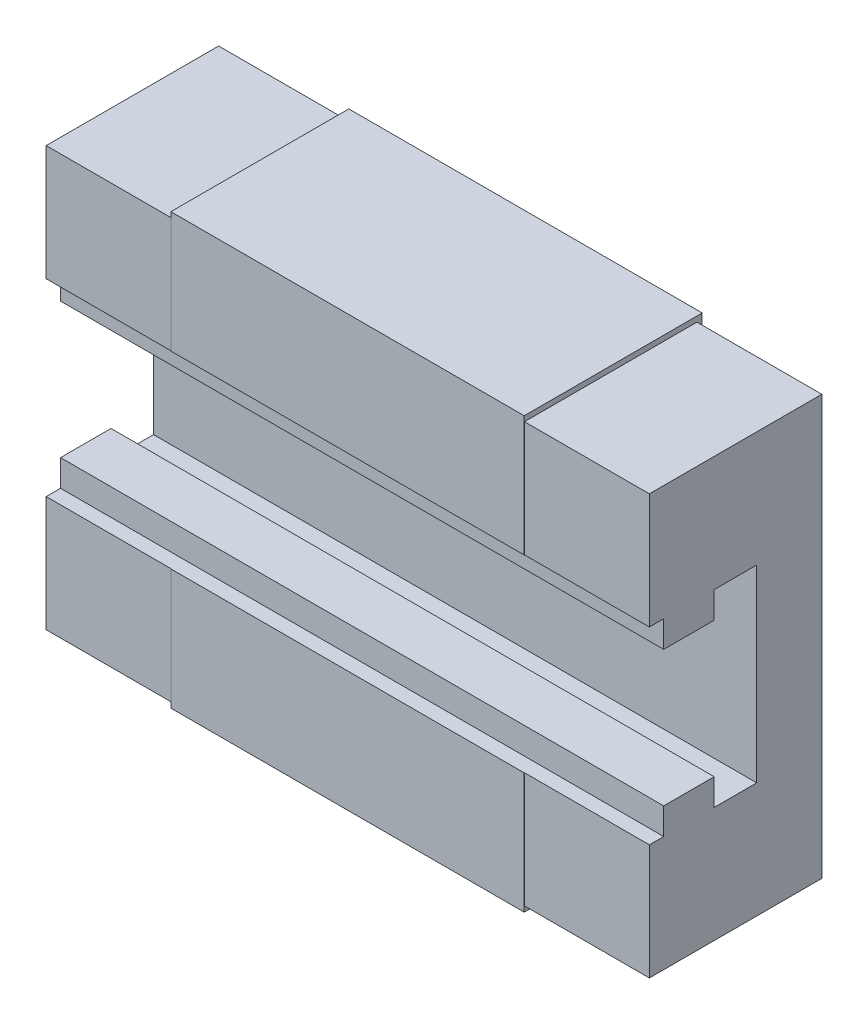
ISO-10303-21;
HEADER;
FILE_DESCRIPTION(('STEP AP214'),'2;1');
FILE_NAME('part.step','',(''),(''),'','','');
FILE_SCHEMA(('AUTOMOTIVE_DESIGN { 1 0 10303 214 1 1 1 1 }'));
ENDSEC;
DATA;
#1=APPLICATION_CONTEXT('core data for automotive mechanical design processes');
#2=APPLICATION_PROTOCOL_DEFINITION('international standard','automotive_design',2000,#1);
#3=PRODUCT_CONTEXT('',#1,'mechanical');
#4=PRODUCT('Part','Part','',(#3));
#5=PRODUCT_RELATED_PRODUCT_CATEGORY('part','',(#4));
#6=PRODUCT_DEFINITION_FORMATION('','',#4);
#7=PRODUCT_DEFINITION_CONTEXT('part definition',#1,'design');
#8=PRODUCT_DEFINITION('design','',#6,#7);
#9=PRODUCT_DEFINITION_SHAPE('','',#8);
#10=(LENGTH_UNIT() NAMED_UNIT(*) SI_UNIT(.MILLI.,.METRE.));
#11=(NAMED_UNIT(*) PLANE_ANGLE_UNIT() SI_UNIT($,.RADIAN.));
#12=(NAMED_UNIT(*) SI_UNIT($,.STERADIAN.) SOLID_ANGLE_UNIT());
#13=UNCERTAINTY_MEASURE_WITH_UNIT(LENGTH_MEASURE(1.E-05),#10,'distance_accuracy_value','');
#14=(GEOMETRIC_REPRESENTATION_CONTEXT(3) GLOBAL_UNCERTAINTY_ASSIGNED_CONTEXT((#13)) GLOBAL_UNIT_ASSIGNED_CONTEXT((#10,
#11,#12)) REPRESENTATION_CONTEXT('',''));
#15=CARTESIAN_POINT('',(0.,0.,0.));
#16=DIRECTION('',(0.,0.,1.));
#17=DIRECTION('',(1.,0.,0.));
#18=AXIS2_PLACEMENT_3D('',#15,#16,#17);
#19=CARTESIAN_POINT('',(0.,0.,6.7));
#20=DIRECTION('',(0.,0.,-1.));
#21=DIRECTION('',(-1.,0.,0.));
#22=AXIS2_PLACEMENT_3D('',#19,#20,#21);
#23=PLANE('',#22);
#24=DIRECTION('',(0.,1.,0.));
#25=VECTOR('',#24,1.);
#26=CARTESIAN_POINT('',(13.3,0.,6.7));
#27=LINE('',#26,#25);
#28=CARTESIAN_POINT('',(13.3,0.,6.7));
#29=VERTEX_POINT('',#28);
#30=CARTESIAN_POINT('',(13.3,4.54,6.7));
#31=VERTEX_POINT('',#30);
#32=EDGE_CURVE('E252',#29,#31,#27,.T.);
#33=ORIENTED_EDGE('',*,*,#32,.T.);
#34=DIRECTION('',(-1.,0.,0.));
#35=VECTOR('',#34,1.);
#36=CARTESIAN_POINT('',(0.,4.54,6.7));
#37=LINE('',#36,#35);
#38=CARTESIAN_POINT('',(0.,4.54,6.7));
#39=VERTEX_POINT('',#38);
#40=EDGE_CURVE('E246',#31,#39,#37,.T.);
#41=ORIENTED_EDGE('',*,*,#40,.T.);
#42=DIRECTION('',(0.,-1.,0.));
#43=VECTOR('',#42,1.);
#44=CARTESIAN_POINT('',(0.,0.,6.7));
#45=LINE('',#44,#43);
#46=CARTESIAN_POINT('',(0.,0.,6.7));
#47=VERTEX_POINT('',#46);
#48=EDGE_CURVE('E230',#39,#47,#45,.T.);
#49=ORIENTED_EDGE('',*,*,#48,.T.);
#50=DIRECTION('',(1.,0.,0.));
#51=VECTOR('',#50,1.);
#52=CARTESIAN_POINT('',(0.,0.,6.7));
#53=LINE('',#52,#51);
#54=EDGE_CURVE('E306',#47,#29,#53,.T.);
#55=ORIENTED_EDGE('',*,*,#54,.T.);
#56=EDGE_LOOP('',(#33,#41,#49,#55));
#57=FACE_BOUND('',#56,.T.);
#58=ADVANCED_FACE('F45',(#57),#23,.F.);
#59=DIRECTION('',(1.,0.,0.));
#60=VECTOR('',#59,1.);
#61=CARTESIAN_POINT('',(0.,11.64,6.7));
#62=LINE('',#61,#60);
#63=CARTESIAN_POINT('',(0.,11.64,6.7));
#64=VERTEX_POINT('',#63);
#65=CARTESIAN_POINT('',(13.3,11.64,6.7));
#66=VERTEX_POINT('',#65);
#67=EDGE_CURVE('E255',#64,#66,#62,.T.);
#68=ORIENTED_EDGE('',*,*,#67,.T.);
#69=CARTESIAN_POINT('',(13.3,16.18,6.7));
#70=VERTEX_POINT('',#69);
#71=EDGE_CURVE('E308',#66,#70,#27,.T.);
#72=ORIENTED_EDGE('',*,*,#71,.T.);
#73=DIRECTION('',(-1.,0.,0.));
#74=VECTOR('',#73,1.);
#75=CARTESIAN_POINT('',(0.,16.18,6.7));
#76=LINE('',#75,#74);
#77=CARTESIAN_POINT('',(0.,16.18,6.7));
#78=VERTEX_POINT('',#77);
#79=EDGE_CURVE('E310',#70,#78,#76,.T.);
#80=ORIENTED_EDGE('',*,*,#79,.T.);
#81=EDGE_CURVE('E239',#78,#64,#45,.T.);
#82=ORIENTED_EDGE('',*,*,#81,.T.);
#83=EDGE_LOOP('',(#68,#72,#80,#82));
#84=FACE_BOUND('',#83,.T.);
#85=ADVANCED_FACE('F343',(#84),#23,.F.);
#86=CARTESIAN_POINT('',(18.,0.20000000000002,0.));
#87=DIRECTION('',(0.,-1.,0.));
#88=DIRECTION('',(0.,0.,-1.));
#89=AXIS2_PLACEMENT_3D('',#86,#87,#88);
#90=PLANE('',#89);
#91=DIRECTION('',(0.,0.,1.));
#92=VECTOR('',#91,1.);
#93=CARTESIAN_POINT('',(18.,0.20000000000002,0.));
#94=LINE('',#93,#92);
#95=CARTESIAN_POINT('',(18.,0.2,0.2));
#96=VERTEX_POINT('',#95);
#97=CARTESIAN_POINT('',(18.,0.2,6.69));
#98=VERTEX_POINT('',#97);
#99=EDGE_CURVE('E283',#96,#98,#94,.T.);
#100=ORIENTED_EDGE('',*,*,#99,.T.);
#101=DIRECTION('',(1.,0.,0.));
#102=VECTOR('',#101,1.);
#103=CARTESIAN_POINT('',(13.3,0.2,6.69));
#104=LINE('',#103,#102);
#105=CARTESIAN_POINT('',(13.3,0.2,6.69));
#106=VERTEX_POINT('',#105);
#107=EDGE_CURVE('E523',#106,#98,#104,.T.);
#108=ORIENTED_EDGE('',*,*,#107,.F.);
#109=DIRECTION('',(0.,0.,1.));
#110=VECTOR('',#109,1.);
#111=CARTESIAN_POINT('',(13.3,0.20000000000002,0.));
#112=LINE('',#111,#110);
#113=CARTESIAN_POINT('',(13.3,0.2,0.2));
#114=VERTEX_POINT('',#113);
#115=EDGE_CURVE('E282',#114,#106,#112,.T.);
#116=ORIENTED_EDGE('',*,*,#115,.F.);
#117=DIRECTION('',(-1.,0.,0.));
#118=VECTOR('',#117,1.);
#119=CARTESIAN_POINT('',(18.,0.2,0.2));
#120=LINE('',#119,#118);
#121=EDGE_CURVE('E302',#96,#114,#120,.T.);
#122=ORIENTED_EDGE('',*,*,#121,.F.);
#123=EDGE_LOOP('',(#100,#108,#116,#122));
#124=FACE_BOUND('',#123,.T.);
#125=ADVANCED_FACE('F531',(#124),#90,.T.);
#126=CARTESIAN_POINT('',(18.,15.98,0.));
#127=DIRECTION('',(0.,-1.,0.));
#128=DIRECTION('',(0.,0.,-1.));
#129=AXIS2_PLACEMENT_3D('',#126,#127,#128);
#130=PLANE('',#129);
#131=DIRECTION('',(-1.,0.,0.));
#132=VECTOR('',#131,1.);
#133=CARTESIAN_POINT('',(18.,15.98,6.69));
#134=LINE('',#133,#132);
#135=CARTESIAN_POINT('',(18.,15.98,6.69));
#136=VERTEX_POINT('',#135);
#137=CARTESIAN_POINT('',(13.3,15.98,6.69));
#138=VERTEX_POINT('',#137);
#139=EDGE_CURVE('E364',#136,#138,#134,.T.);
#140=ORIENTED_EDGE('',*,*,#139,.F.);
#141=DIRECTION('',(0.,0.,1.));
#142=VECTOR('',#141,1.);
#143=CARTESIAN_POINT('',(18.,15.98,0.));
#144=LINE('',#143,#142);
#145=CARTESIAN_POINT('',(18.,15.98,0.2));
#146=VERTEX_POINT('',#145);
#147=EDGE_CURVE('E289',#146,#136,#144,.T.);
#148=ORIENTED_EDGE('',*,*,#147,.F.);
#149=DIRECTION('',(-1.,0.,0.));
#150=VECTOR('',#149,1.);
#151=CARTESIAN_POINT('',(18.,15.98,0.2));
#152=LINE('',#151,#150);
#153=CARTESIAN_POINT('',(13.3,15.98,0.2));
#154=VERTEX_POINT('',#153);
#155=EDGE_CURVE('E292',#146,#154,#152,.T.);
#156=ORIENTED_EDGE('',*,*,#155,.T.);
#157=DIRECTION('',(0.,0.,1.));
#158=VECTOR('',#157,1.);
#159=CARTESIAN_POINT('',(13.3,15.98,0.));
#160=LINE('',#159,#158);
#161=EDGE_CURVE('E287',#154,#138,#160,.T.);
#162=ORIENTED_EDGE('',*,*,#161,.T.);
#163=EDGE_LOOP('',(#140,#148,#156,#162));
#164=FACE_BOUND('',#163,.T.);
#165=ADVANCED_FACE('F541',(#164),#130,.F.);
#166=CARTESIAN_POINT('',(18.,0.,0.));
#167=DIRECTION('',(1.,0.,0.));
#168=DIRECTION('',(0.,0.,-1.));
#169=AXIS2_PLACEMENT_3D('',#166,#167,#168);
#170=PLANE('',#169);
#171=ORIENTED_EDGE('',*,*,#147,.T.);
#172=DIRECTION('',(0.,1.,0.));
#173=VECTOR('',#172,1.);
#174=CARTESIAN_POINT('',(18.,11.64,6.69));
#175=LINE('',#174,#173);
#176=CARTESIAN_POINT('',(18.,11.64,6.69));
#177=VERTEX_POINT('',#176);
#178=EDGE_CURVE('E355',#177,#136,#175,.T.);
#179=ORIENTED_EDGE('',*,*,#178,.F.);
#180=DIRECTION('',(0.,0.,1.));
#181=VECTOR('',#180,1.);
#182=CARTESIAN_POINT('',(18.,11.64,6.15));
#183=LINE('',#182,#181);
#184=CARTESIAN_POINT('',(18.,11.64,6.15));
#185=VERTEX_POINT('',#184);
#186=EDGE_CURVE('E451',#185,#177,#183,.T.);
#187=ORIENTED_EDGE('',*,*,#186,.F.);
#188=DIRECTION('',(0.,1.,0.));
#189=VECTOR('',#188,1.);
#190=CARTESIAN_POINT('',(18.,10.64,6.15));
#191=LINE('',#190,#189);
#192=CARTESIAN_POINT('',(18.,10.64,6.15));
#193=VERTEX_POINT('',#192);
#194=EDGE_CURVE('E448',#193,#185,#191,.T.);
#195=ORIENTED_EDGE('',*,*,#194,.F.);
#196=DIRECTION('',(0.,0.,1.));
#197=VECTOR('',#196,1.);
#198=CARTESIAN_POINT('',(18.,10.64,4.25));
#199=LINE('',#198,#197);
#200=CARTESIAN_POINT('',(18.,10.64,4.25));
#201=VERTEX_POINT('',#200);
#202=EDGE_CURVE('E445',#201,#193,#199,.T.);
#203=ORIENTED_EDGE('',*,*,#202,.F.);
#204=DIRECTION('',(0.,-1.,0.));
#205=VECTOR('',#204,1.);
#206=CARTESIAN_POINT('',(18.,11.64,4.25));
#207=LINE('',#206,#205);
#208=CARTESIAN_POINT('',(18.,11.64,4.25));
#209=VERTEX_POINT('',#208);
#210=EDGE_CURVE('E442',#209,#201,#207,.T.);
#211=ORIENTED_EDGE('',*,*,#210,.F.);
#212=DIRECTION('',(0.,0.,1.));
#213=VECTOR('',#212,1.);
#214=CARTESIAN_POINT('',(18.,11.64,2.65));
#215=LINE('',#214,#213);
#216=CARTESIAN_POINT('',(18.,11.64,2.65));
#217=VERTEX_POINT('',#216);
#218=EDGE_CURVE('E439',#217,#209,#215,.T.);
#219=ORIENTED_EDGE('',*,*,#218,.F.);
#220=DIRECTION('',(0.,1.,0.));
#221=VECTOR('',#220,1.);
#222=CARTESIAN_POINT('',(18.,4.54,2.65));
#223=LINE('',#222,#221);
#224=CARTESIAN_POINT('',(18.,4.54,2.65));
#225=VERTEX_POINT('',#224);
#226=EDGE_CURVE('E402',#225,#217,#223,.T.);
#227=ORIENTED_EDGE('',*,*,#226,.F.);
#228=DIRECTION('',(0.,0.,-1.));
#229=VECTOR('',#228,1.);
#230=CARTESIAN_POINT('',(18.,4.54,4.25));
#231=LINE('',#230,#229);
#232=CARTESIAN_POINT('',(18.,4.54,4.25));
#233=VERTEX_POINT('',#232);
#234=EDGE_CURVE('E409',#233,#225,#231,.T.);
#235=ORIENTED_EDGE('',*,*,#234,.F.);
#236=DIRECTION('',(0.,-1.,0.));
#237=VECTOR('',#236,1.);
#238=CARTESIAN_POINT('',(18.,5.54,4.25));
#239=LINE('',#238,#237);
#240=CARTESIAN_POINT('',(18.,5.54,4.25));
#241=VERTEX_POINT('',#240);
#242=EDGE_CURVE('E461',#241,#233,#239,.T.);
#243=ORIENTED_EDGE('',*,*,#242,.F.);
#244=DIRECTION('',(0.,0.,-1.));
#245=VECTOR('',#244,1.);
#246=CARTESIAN_POINT('',(18.,5.54,6.15));
#247=LINE('',#246,#245);
#248=CARTESIAN_POINT('',(18.,5.54,6.15));
#249=VERTEX_POINT('',#248);
#250=EDGE_CURVE('E458',#249,#241,#247,.T.);
#251=ORIENTED_EDGE('',*,*,#250,.F.);
#252=DIRECTION('',(0.,1.,0.));
#253=VECTOR('',#252,1.);
#254=CARTESIAN_POINT('',(18.,4.54,6.15));
#255=LINE('',#254,#253);
#256=CARTESIAN_POINT('',(18.,4.54,6.15));
#257=VERTEX_POINT('',#256);
#258=EDGE_CURVE('E455',#257,#249,#255,.T.);
#259=ORIENTED_EDGE('',*,*,#258,.F.);
#260=DIRECTION('',(0.,0.,-1.));
#261=VECTOR('',#260,1.);
#262=CARTESIAN_POINT('',(18.,4.54,7.75));
#263=LINE('',#262,#261);
#264=CARTESIAN_POINT('',(18.,4.54,6.69));
#265=VERTEX_POINT('',#264);
#266=EDGE_CURVE('E453',#265,#257,#263,.T.);
#267=ORIENTED_EDGE('',*,*,#266,.F.);
#268=DIRECTION('',(0.,1.,0.));
#269=VECTOR('',#268,1.);
#270=CARTESIAN_POINT('',(18.,0.2,6.69));
#271=LINE('',#270,#269);
#272=EDGE_CURVE('E68',#98,#265,#271,.T.);
#273=ORIENTED_EDGE('',*,*,#272,.F.);
#274=ORIENTED_EDGE('',*,*,#99,.F.);
#275=DIRECTION('',(0.,1.,0.));
#276=VECTOR('',#275,1.);
#277=CARTESIAN_POINT('',(18.,0.,0.2));
#278=LINE('',#277,#276);
#279=EDGE_CURVE('E286',#96,#146,#278,.T.);
#280=ORIENTED_EDGE('',*,*,#279,.T.);
#281=EDGE_LOOP('',(#171,#179,#187,#195,#203,#211,#219,#227,#235,#243,#251,#259,#267,#273,#274,#280));
#282=FACE_BOUND('',#281,.T.);
#283=ADVANCED_FACE('F495',(#282),#170,.T.);
#284=CARTESIAN_POINT('',(-4.7,15.98,0.));
#285=DIRECTION('',(0.,-1.,0.));
#286=DIRECTION('',(0.,0.,-1.));
#287=AXIS2_PLACEMENT_3D('',#284,#285,#286);
#288=PLANE('',#287);
#289=DIRECTION('',(-1.,0.,0.));
#290=VECTOR('',#289,1.);
#291=CARTESIAN_POINT('',(0.,15.98,6.69));
#292=LINE('',#291,#290);
#293=CARTESIAN_POINT('',(0.,15.98,6.69));
#294=VERTEX_POINT('',#293);
#295=CARTESIAN_POINT('',(-4.7,15.98,6.69));
#296=VERTEX_POINT('',#295);
#297=EDGE_CURVE('E376',#294,#296,#292,.T.);
#298=ORIENTED_EDGE('',*,*,#297,.F.);
#299=DIRECTION('',(0.,0.,-1.));
#300=VECTOR('',#299,1.);
#301=CARTESIAN_POINT('',(0.,15.98,0.));
#302=LINE('',#301,#300);
#303=CARTESIAN_POINT('',(0.,15.98,0.2));
#304=VERTEX_POINT('',#303);
#305=EDGE_CURVE('E258',#294,#304,#302,.T.);
#306=ORIENTED_EDGE('',*,*,#305,.T.);
#307=DIRECTION('',(1.,0.,0.));
#308=VECTOR('',#307,1.);
#309=CARTESIAN_POINT('',(-4.7,15.98,0.2));
#310=LINE('',#309,#308);
#311=CARTESIAN_POINT('',(-4.7,15.98,0.2));
#312=VERTEX_POINT('',#311);
#313=EDGE_CURVE('E279',#312,#304,#310,.T.);
#314=ORIENTED_EDGE('',*,*,#313,.F.);
#315=DIRECTION('',(0.,0.,-1.));
#316=VECTOR('',#315,1.);
#317=CARTESIAN_POINT('',(-4.7,15.98,0.));
#318=LINE('',#317,#316);
#319=EDGE_CURVE('E268',#296,#312,#318,.T.);
#320=ORIENTED_EDGE('',*,*,#319,.F.);
#321=EDGE_LOOP('',(#298,#306,#314,#320));
#322=FACE_BOUND('',#321,.T.);
#323=ADVANCED_FACE('F603',(#322),#288,.F.);
#324=CARTESIAN_POINT('',(-4.7,0.,0.));
#325=DIRECTION('',(-1.,0.,0.));
#326=DIRECTION('',(0.,0.,1.));
#327=AXIS2_PLACEMENT_3D('',#324,#325,#326);
#328=PLANE('',#327);
#329=DIRECTION('',(0.,-1.,0.));
#330=VECTOR('',#329,1.);
#331=CARTESIAN_POINT('',(-4.7,4.54,6.69));
#332=LINE('',#331,#330);
#333=CARTESIAN_POINT('',(-4.7,4.54,6.69));
#334=VERTEX_POINT('',#333);
#335=CARTESIAN_POINT('',(-4.7,0.199999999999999,6.69));
#336=VERTEX_POINT('',#335);
#337=EDGE_CURVE('E248',#334,#336,#332,.T.);
#338=ORIENTED_EDGE('',*,*,#337,.F.);
#339=DIRECTION('',(0.,0.,1.));
#340=VECTOR('',#339,1.);
#341=CARTESIAN_POINT('',(-4.7,4.54,0.));
#342=LINE('',#341,#340);
#343=CARTESIAN_POINT('',(-4.7,4.54,6.15));
#344=VERTEX_POINT('',#343);
#345=EDGE_CURVE('E11',#344,#334,#342,.T.);
#346=ORIENTED_EDGE('',*,*,#345,.F.);
#347=DIRECTION('',(0.,1.,0.));
#348=VECTOR('',#347,1.);
#349=CARTESIAN_POINT('',(-4.7,4.54,6.15));
#350=LINE('',#349,#348);
#351=CARTESIAN_POINT('',(-4.7,5.54,6.15));
#352=VERTEX_POINT('',#351);
#353=EDGE_CURVE('E424',#344,#352,#350,.T.);
#354=ORIENTED_EDGE('',*,*,#353,.T.);
#355=DIRECTION('',(0.,0.,-1.));
#356=VECTOR('',#355,1.);
#357=CARTESIAN_POINT('',(-4.7,5.54,6.15));
#358=LINE('',#357,#356);
#359=CARTESIAN_POINT('',(-4.7,5.54,4.25));
#360=VERTEX_POINT('',#359);
#361=EDGE_CURVE('E427',#352,#360,#358,.T.);
#362=ORIENTED_EDGE('',*,*,#361,.T.);
#363=DIRECTION('',(0.,-1.,0.));
#364=VECTOR('',#363,1.);
#365=CARTESIAN_POINT('',(-4.7,5.54,4.25));
#366=LINE('',#365,#364);
#367=CARTESIAN_POINT('',(-4.7,4.54,4.25));
#368=VERTEX_POINT('',#367);
#369=EDGE_CURVE('E430',#360,#368,#366,.T.);
#370=ORIENTED_EDGE('',*,*,#369,.T.);
#371=DIRECTION('',(0.,0.,-1.));
#372=VECTOR('',#371,1.);
#373=CARTESIAN_POINT('',(-4.7,4.54,4.25));
#374=LINE('',#373,#372);
#375=CARTESIAN_POINT('',(-4.7,4.54,2.65));
#376=VERTEX_POINT('',#375);
#377=EDGE_CURVE('E433',#368,#376,#374,.T.);
#378=ORIENTED_EDGE('',*,*,#377,.T.);
#379=DIRECTION('',(0.,1.,0.));
#380=VECTOR('',#379,1.);
#381=CARTESIAN_POINT('',(-4.7,4.54,2.65));
#382=LINE('',#381,#380);
#383=CARTESIAN_POINT('',(-4.7,11.64,2.65));
#384=VERTEX_POINT('',#383);
#385=EDGE_CURVE('E405',#376,#384,#382,.T.);
#386=ORIENTED_EDGE('',*,*,#385,.T.);
#387=DIRECTION('',(0.,0.,1.));
#388=VECTOR('',#387,1.);
#389=CARTESIAN_POINT('',(-4.7,11.64,2.65));
#390=LINE('',#389,#388);
#391=CARTESIAN_POINT('',(-4.7,11.64,4.25));
#392=VERTEX_POINT('',#391);
#393=EDGE_CURVE('E408',#384,#392,#390,.T.);
#394=ORIENTED_EDGE('',*,*,#393,.T.);
#395=DIRECTION('',(0.,-1.,0.));
#396=VECTOR('',#395,1.);
#397=CARTESIAN_POINT('',(-4.7,11.64,4.25));
#398=LINE('',#397,#396);
#399=CARTESIAN_POINT('',(-4.7,10.64,4.25));
#400=VERTEX_POINT('',#399);
#401=EDGE_CURVE('E412',#392,#400,#398,.T.);
#402=ORIENTED_EDGE('',*,*,#401,.T.);
#403=DIRECTION('',(0.,0.,1.));
#404=VECTOR('',#403,1.);
#405=CARTESIAN_POINT('',(-4.7,10.64,4.25));
#406=LINE('',#405,#404);
#407=CARTESIAN_POINT('',(-4.7,10.64,6.15));
#408=VERTEX_POINT('',#407);
#409=EDGE_CURVE('E415',#400,#408,#406,.T.);
#410=ORIENTED_EDGE('',*,*,#409,.T.);
#411=DIRECTION('',(0.,1.,0.));
#412=VECTOR('',#411,1.);
#413=CARTESIAN_POINT('',(-4.7,10.64,6.15));
#414=LINE('',#413,#412);
#415=CARTESIAN_POINT('',(-4.7,11.64,6.15));
#416=VERTEX_POINT('',#415);
#417=EDGE_CURVE('E418',#408,#416,#414,.T.);
#418=ORIENTED_EDGE('',*,*,#417,.T.);
#419=DIRECTION('',(0.,0.,1.));
#420=VECTOR('',#419,1.);
#421=CARTESIAN_POINT('',(-4.7,11.64,6.15));
#422=LINE('',#421,#420);
#423=CARTESIAN_POINT('',(-4.7,11.64,6.69));
#424=VERTEX_POINT('',#423);
#425=EDGE_CURVE('E421',#416,#424,#422,.T.);
#426=ORIENTED_EDGE('',*,*,#425,.T.);
#427=DIRECTION('',(0.,-1.,0.));
#428=VECTOR('',#427,1.);
#429=CARTESIAN_POINT('',(-4.7,15.98,6.69));
#430=LINE('',#429,#428);
#431=EDGE_CURVE('E374',#296,#424,#430,.T.);
#432=ORIENTED_EDGE('',*,*,#431,.F.);
#433=ORIENTED_EDGE('',*,*,#319,.T.);
#434=DIRECTION('',(0.,-1.,0.));
#435=VECTOR('',#434,1.);
#436=CARTESIAN_POINT('',(-4.7,0.,0.2));
#437=LINE('',#436,#435);
#438=CARTESIAN_POINT('',(-4.7,0.2,0.2));
#439=VERTEX_POINT('',#438);
#440=EDGE_CURVE('E271',#312,#439,#437,.T.);
#441=ORIENTED_EDGE('',*,*,#440,.T.);
#442=DIRECTION('',(0.,0.,1.));
#443=VECTOR('',#442,1.);
#444=CARTESIAN_POINT('',(-4.7,0.2,0.));
#445=LINE('',#444,#443);
#446=EDGE_CURVE('E265',#439,#336,#445,.T.);
#447=ORIENTED_EDGE('',*,*,#446,.T.);
#448=EDGE_LOOP('',(#338,#346,#354,#362,#370,#378,#386,#394,#402,#410,#418,#426,#432,#433,#441,#447));
#449=FACE_BOUND('',#448,.T.);
#450=ADVANCED_FACE('F503',(#449),#328,.T.);
#451=CARTESIAN_POINT('',(-4.7,4.54,7.75));
#452=DIRECTION('',(0.,-1.,0.));
#453=DIRECTION('',(0.,0.,-1.));
#454=AXIS2_PLACEMENT_3D('',#451,#452,#453);
#455=PLANE('',#454);
#456=ORIENTED_EDGE('',*,*,#40,.F.);
#457=DIRECTION('',(0.,0.,1.));
#458=VECTOR('',#457,1.);
#459=CARTESIAN_POINT('',(13.3,4.54,6.69));
#460=LINE('',#459,#458);
#461=CARTESIAN_POINT('',(13.3,4.54,6.69));
#462=VERTEX_POINT('',#461);
#463=EDGE_CURVE('E367',#462,#31,#460,.T.);
#464=ORIENTED_EDGE('',*,*,#463,.F.);
#465=DIRECTION('',(-1.,0.,0.));
#466=VECTOR('',#465,1.);
#467=CARTESIAN_POINT('',(18.,4.54,6.69));
#468=LINE('',#467,#466);
#469=EDGE_CURVE('E521',#265,#462,#468,.T.);
#470=ORIENTED_EDGE('',*,*,#469,.F.);
#471=ORIENTED_EDGE('',*,*,#266,.T.);
#472=DIRECTION('',(1.,0.,0.));
#473=VECTOR('',#472,1.);
#474=CARTESIAN_POINT('',(-4.7,4.54,6.15));
#475=LINE('',#474,#473);
#476=EDGE_CURVE('E473',#344,#257,#475,.T.);
#477=ORIENTED_EDGE('',*,*,#476,.F.);
#478=ORIENTED_EDGE('',*,*,#345,.T.);
#479=DIRECTION('',(-1.,0.,0.));
#480=VECTOR('',#479,1.);
#481=CARTESIAN_POINT('',(0.,4.54,6.69));
#482=LINE('',#481,#480);
#483=CARTESIAN_POINT('',(0.,4.54,6.69));
#484=VERTEX_POINT('',#483);
#485=EDGE_CURVE('E247',#484,#334,#482,.T.);
#486=ORIENTED_EDGE('',*,*,#485,.F.);
#487=DIRECTION('',(0.,0.,1.));
#488=VECTOR('',#487,1.);
#489=CARTESIAN_POINT('',(0.,4.54,6.69));
#490=LINE('',#489,#488);
#491=EDGE_CURVE('E232',#484,#39,#490,.T.);
#492=ORIENTED_EDGE('',*,*,#491,.T.);
#493=EDGE_LOOP('',(#456,#464,#470,#471,#477,#478,#486,#492));
#494=FACE_BOUND('',#493,.T.);
#495=ADVANCED_FACE('F244',(#494),#455,.F.);
#496=CARTESIAN_POINT('',(-4.7,11.64,6.15));
#497=DIRECTION('',(0.,1.,0.));
#498=DIRECTION('',(0.,0.,1.));
#499=AXIS2_PLACEMENT_3D('',#496,#497,#498);
#500=PLANE('',#499);
#501=DIRECTION('',(1.,0.,0.));
#502=VECTOR('',#501,1.);
#503=CARTESIAN_POINT('',(13.3,11.64,6.69));
#504=LINE('',#503,#502);
#505=CARTESIAN_POINT('',(13.3,11.64,6.69));
#506=VERTEX_POINT('',#505);
#507=EDGE_CURVE('E354',#506,#177,#504,.T.);
#508=ORIENTED_EDGE('',*,*,#507,.F.);
#509=DIRECTION('',(0.,0.,1.));
#510=VECTOR('',#509,1.);
#511=CARTESIAN_POINT('',(13.3,11.64,6.69));
#512=LINE('',#511,#510);
#513=EDGE_CURVE('E348',#506,#66,#512,.T.);
#514=ORIENTED_EDGE('',*,*,#513,.T.);
#515=ORIENTED_EDGE('',*,*,#67,.F.);
#516=DIRECTION('',(0.,0.,1.));
#517=VECTOR('',#516,1.);
#518=CARTESIAN_POINT('',(0.,11.64,6.69));
#519=LINE('',#518,#517);
#520=CARTESIAN_POINT('',(0.,11.64,6.69));
#521=VERTEX_POINT('',#520);
#522=EDGE_CURVE('E378',#521,#64,#519,.T.);
#523=ORIENTED_EDGE('',*,*,#522,.F.);
#524=DIRECTION('',(1.,0.,0.));
#525=VECTOR('',#524,1.);
#526=CARTESIAN_POINT('',(-4.7,11.64,6.69));
#527=LINE('',#526,#525);
#528=EDGE_CURVE('E370',#424,#521,#527,.T.);
#529=ORIENTED_EDGE('',*,*,#528,.F.);
#530=ORIENTED_EDGE('',*,*,#425,.F.);
#531=DIRECTION('',(1.,0.,0.));
#532=VECTOR('',#531,1.);
#533=CARTESIAN_POINT('',(-4.7,11.64,6.15));
#534=LINE('',#533,#532);
#535=EDGE_CURVE('E476',#416,#185,#534,.T.);
#536=ORIENTED_EDGE('',*,*,#535,.T.);
#537=ORIENTED_EDGE('',*,*,#186,.T.);
#538=EDGE_LOOP('',(#508,#514,#515,#523,#529,#530,#536,#537));
#539=FACE_BOUND('',#538,.T.);
#540=ADVANCED_FACE('F351',(#539),#500,.F.);
#541=CARTESIAN_POINT('',(0.,0.,6.7));
#542=DIRECTION('',(1.,0.,0.));
#543=DIRECTION('',(0.,0.,-1.));
#544=AXIS2_PLACEMENT_3D('',#541,#542,#543);
#545=PLANE('',#544);
#546=DIRECTION('',(0.,0.,1.));
#547=VECTOR('',#546,1.);
#548=CARTESIAN_POINT('',(0.,0.2,0.));
#549=LINE('',#548,#547);
#550=CARTESIAN_POINT('',(0.,0.2,0.2));
#551=VERTEX_POINT('',#550);
#552=CARTESIAN_POINT('',(0.,0.2,6.69));
#553=VERTEX_POINT('',#552);
#554=EDGE_CURVE('E254',#551,#553,#549,.T.);
#555=ORIENTED_EDGE('',*,*,#554,.F.);
#556=DIRECTION('',(0.,-1.,0.));
#557=VECTOR('',#556,1.);
#558=CARTESIAN_POINT('',(0.,0.,0.2));
#559=LINE('',#558,#557);
#560=EDGE_CURVE('E269',#304,#551,#559,.T.);
#561=ORIENTED_EDGE('',*,*,#560,.F.);
#562=ORIENTED_EDGE('',*,*,#305,.F.);
#563=DIRECTION('',(0.,-1.,0.));
#564=VECTOR('',#563,1.);
#565=CARTESIAN_POINT('',(0.,15.98,6.69));
#566=LINE('',#565,#564);
#567=EDGE_CURVE('E368',#294,#521,#566,.T.);
#568=ORIENTED_EDGE('',*,*,#567,.T.);
#569=ORIENTED_EDGE('',*,*,#522,.T.);
#570=ORIENTED_EDGE('',*,*,#81,.F.);
#571=DIRECTION('',(0.,0.,-1.));
#572=VECTOR('',#571,1.);
#573=CARTESIAN_POINT('',(0.,16.18,6.7));
#574=LINE('',#573,#572);
#575=CARTESIAN_POINT('',(0.,16.18,0.));
#576=VERTEX_POINT('',#575);
#577=EDGE_CURVE('E312',#78,#576,#574,.T.);
#578=ORIENTED_EDGE('',*,*,#577,.T.);
#579=DIRECTION('',(0.,-1.,0.));
#580=VECTOR('',#579,1.);
#581=CARTESIAN_POINT('',(0.,0.,0.));
#582=LINE('',#581,#580);
#583=CARTESIAN_POINT('',(0.,0.,0.));
#584=VERTEX_POINT('',#583);
#585=EDGE_CURVE('E304',#576,#584,#582,.T.);
#586=ORIENTED_EDGE('',*,*,#585,.T.);
#587=DIRECTION('',(0.,0.,-1.));
#588=VECTOR('',#587,1.);
#589=CARTESIAN_POINT('',(0.,0.,6.7));
#590=LINE('',#589,#588);
#591=EDGE_CURVE('E53',#47,#584,#590,.T.);
#592=ORIENTED_EDGE('',*,*,#591,.F.);
#593=ORIENTED_EDGE('',*,*,#48,.F.);
#594=ORIENTED_EDGE('',*,*,#491,.F.);
#595=DIRECTION('',(0.,-1.,0.));
#596=VECTOR('',#595,1.);
#597=CARTESIAN_POINT('',(0.,4.54,6.69));
#598=LINE('',#597,#596);
#599=EDGE_CURVE('E60',#484,#553,#598,.T.);
#600=ORIENTED_EDGE('',*,*,#599,.T.);
#601=EDGE_LOOP('',(#555,#561,#562,#568,#569,#570,#578,#586,#592,#593,#594,#600));
#602=FACE_BOUND('',#601,.T.);
#603=ADVANCED_FACE('F47',(#602),#545,.F.);
#604=CARTESIAN_POINT('',(0.,0.,6.7));
#605=DIRECTION('',(0.,1.,0.));
#606=DIRECTION('',(0.,0.,1.));
#607=AXIS2_PLACEMENT_3D('',#604,#605,#606);
#608=PLANE('',#607);
#609=DIRECTION('',(1.,0.,0.));
#610=VECTOR('',#609,1.);
#611=CARTESIAN_POINT('',(0.,0.,0.));
#612=LINE('',#611,#610);
#613=CARTESIAN_POINT('',(13.3,0.,0.));
#614=VERTEX_POINT('',#613);
#615=EDGE_CURVE('E314',#584,#614,#612,.T.);
#616=ORIENTED_EDGE('',*,*,#615,.T.);
#617=DIRECTION('',(0.,0.,-1.));
#618=VECTOR('',#617,1.);
#619=CARTESIAN_POINT('',(13.3,0.,6.7));
#620=LINE('',#619,#618);
#621=EDGE_CURVE('E324',#29,#614,#620,.T.);
#622=ORIENTED_EDGE('',*,*,#621,.F.);
#623=ORIENTED_EDGE('',*,*,#54,.F.);
#624=ORIENTED_EDGE('',*,*,#591,.T.);
#625=EDGE_LOOP('',(#616,#622,#623,#624));
#626=FACE_BOUND('',#625,.T.);
#627=ADVANCED_FACE('F327',(#626),#608,.F.);
#628=CARTESIAN_POINT('',(13.3,0.,6.7));
#629=DIRECTION('',(-1.,0.,0.));
#630=DIRECTION('',(0.,0.,1.));
#631=AXIS2_PLACEMENT_3D('',#628,#629,#630);
#632=PLANE('',#631);
#633=DIRECTION('',(0.,1.,0.));
#634=VECTOR('',#633,1.);
#635=CARTESIAN_POINT('',(13.3,0.,0.2));
#636=LINE('',#635,#634);
#637=EDGE_CURVE('E295',#114,#154,#636,.T.);
#638=ORIENTED_EDGE('',*,*,#637,.F.);
#639=ORIENTED_EDGE('',*,*,#115,.T.);
#640=DIRECTION('',(0.,-1.,0.));
#641=VECTOR('',#640,1.);
#642=CARTESIAN_POINT('',(13.3,4.54,6.69));
#643=LINE('',#642,#641);
#644=EDGE_CURVE('E249',#462,#106,#643,.T.);
#645=ORIENTED_EDGE('',*,*,#644,.F.);
#646=ORIENTED_EDGE('',*,*,#463,.T.);
#647=ORIENTED_EDGE('',*,*,#32,.F.);
#648=ORIENTED_EDGE('',*,*,#621,.T.);
#649=DIRECTION('',(0.,1.,0.));
#650=VECTOR('',#649,1.);
#651=CARTESIAN_POINT('',(13.3,0.,0.));
#652=LINE('',#651,#650);
#653=CARTESIAN_POINT('',(13.3,16.18,0.));
#654=VERTEX_POINT('',#653);
#655=EDGE_CURVE('E316',#614,#654,#652,.T.);
#656=ORIENTED_EDGE('',*,*,#655,.T.);
#657=DIRECTION('',(0.,0.,-1.));
#658=VECTOR('',#657,1.);
#659=CARTESIAN_POINT('',(13.3,16.18,6.7));
#660=LINE('',#659,#658);
#661=EDGE_CURVE('E321',#70,#654,#660,.T.);
#662=ORIENTED_EDGE('',*,*,#661,.F.);
#663=ORIENTED_EDGE('',*,*,#71,.F.);
#664=ORIENTED_EDGE('',*,*,#513,.F.);
#665=DIRECTION('',(0.,-1.,0.));
#666=VECTOR('',#665,1.);
#667=CARTESIAN_POINT('',(13.3,15.98,6.69));
#668=LINE('',#667,#666);
#669=EDGE_CURVE('E362',#138,#506,#668,.T.);
#670=ORIENTED_EDGE('',*,*,#669,.F.);
#671=ORIENTED_EDGE('',*,*,#161,.F.);
#672=EDGE_LOOP('',(#638,#639,#645,#646,#647,#648,#656,#662,#663,#664,#670,#671));
#673=FACE_BOUND('',#672,.T.);
#674=ADVANCED_FACE('F338',(#673),#632,.F.);
#675=CARTESIAN_POINT('',(0.,16.18,6.7));
#676=DIRECTION('',(0.,-1.,0.));
#677=DIRECTION('',(0.,0.,-1.));
#678=AXIS2_PLACEMENT_3D('',#675,#676,#677);
#679=PLANE('',#678);
#680=DIRECTION('',(-1.,0.,0.));
#681=VECTOR('',#680,1.);
#682=CARTESIAN_POINT('',(0.,16.18,0.));
#683=LINE('',#682,#681);
#684=EDGE_CURVE('E240',#654,#576,#683,.T.);
#685=ORIENTED_EDGE('',*,*,#684,.T.);
#686=ORIENTED_EDGE('',*,*,#577,.F.);
#687=ORIENTED_EDGE('',*,*,#79,.F.);
#688=ORIENTED_EDGE('',*,*,#661,.T.);
#689=EDGE_LOOP('',(#685,#686,#687,#688));
#690=FACE_BOUND('',#689,.T.);
#691=ADVANCED_FACE('F341',(#690),#679,.F.);
#692=CARTESIAN_POINT('',(0.,0.,0.));
#693=DIRECTION('',(0.,0.,-1.));
#694=DIRECTION('',(-1.,0.,0.));
#695=AXIS2_PLACEMENT_3D('',#692,#693,#694);
#696=PLANE('',#695);
#697=CARTESIAN_POINT('',(2.65,14.09,0.));
#698=DIRECTION('',(0.,0.,-1.));
#699=DIRECTION('',(-1.,0.,0.));
#700=AXIS2_PLACEMENT_3D('',#697,#698,#699);
#701=CIRCLE('',#700,1.05);
#702=CARTESIAN_POINT('',(1.6,14.09,0.));
#703=VERTEX_POINT('',#702);
#704=EDGE_CURVE('E391',#703,#703,#701,.T.);
#705=ORIENTED_EDGE('',*,*,#704,.F.);
#706=EDGE_LOOP('',(#705));
#707=FACE_BOUND('',#706,.T.);
#708=CARTESIAN_POINT('',(10.65,2.09,0.));
#709=DIRECTION('',(0.,0.,-1.));
#710=DIRECTION('',(-1.,0.,0.));
#711=AXIS2_PLACEMENT_3D('',#708,#709,#710);
#712=CIRCLE('',#711,1.05);
#713=CARTESIAN_POINT('',(9.6,2.09,0.));
#714=VERTEX_POINT('',#713);
#715=EDGE_CURVE('E384',#714,#714,#712,.T.);
#716=ORIENTED_EDGE('',*,*,#715,.F.);
#717=EDGE_LOOP('',(#716));
#718=FACE_BOUND('',#717,.T.);
#719=CARTESIAN_POINT('',(2.65,2.09,0.));
#720=DIRECTION('',(0.,0.,-1.));
#721=DIRECTION('',(-1.,0.,0.));
#722=AXIS2_PLACEMENT_3D('',#719,#720,#721);
#723=CIRCLE('',#722,1.05);
#724=CARTESIAN_POINT('',(1.6,2.09,0.));
#725=VERTEX_POINT('',#724);
#726=EDGE_CURVE('E380',#725,#725,#723,.T.);
#727=ORIENTED_EDGE('',*,*,#726,.F.);
#728=EDGE_LOOP('',(#727));
#729=FACE_BOUND('',#728,.T.);
#730=CARTESIAN_POINT('',(10.65,14.09,0.));
#731=DIRECTION('',(0.,0.,-1.));
#732=DIRECTION('',(-1.,0.,0.));
#733=AXIS2_PLACEMENT_3D('',#730,#731,#732);
#734=CIRCLE('',#733,1.05);
#735=CARTESIAN_POINT('',(9.6,14.09,0.));
#736=VERTEX_POINT('',#735);
#737=EDGE_CURVE('E390',#736,#736,#734,.T.);
#738=ORIENTED_EDGE('',*,*,#737,.F.);
#739=EDGE_LOOP('',(#738));
#740=FACE_BOUND('',#739,.T.);
#741=ORIENTED_EDGE('',*,*,#585,.F.);
#742=ORIENTED_EDGE('',*,*,#684,.F.);
#743=ORIENTED_EDGE('',*,*,#655,.F.);
#744=ORIENTED_EDGE('',*,*,#615,.F.);
#745=EDGE_LOOP('',(#741,#742,#743,#744));
#746=FACE_BOUND('',#745,.T.);
#747=ADVANCED_FACE('F334',(#707,#718,#729,#740,#746),#696,.T.);
#748=CARTESIAN_POINT('',(18.,0.,0.2));
#749=DIRECTION('',(0.,0.,1.));
#750=DIRECTION('',(1.,0.,0.));
#751=AXIS2_PLACEMENT_3D('',#748,#749,#750);
#752=PLANE('',#751);
#753=ORIENTED_EDGE('',*,*,#637,.T.);
#754=ORIENTED_EDGE('',*,*,#155,.F.);
#755=ORIENTED_EDGE('',*,*,#279,.F.);
#756=ORIENTED_EDGE('',*,*,#121,.T.);
#757=EDGE_LOOP('',(#753,#754,#755,#756));
#758=FACE_BOUND('',#757,.T.);
#759=ADVANCED_FACE('F535',(#758),#752,.F.);
#760=CARTESIAN_POINT('',(-4.7,0.2,0.));
#761=DIRECTION('',(0.,1.,0.));
#762=DIRECTION('',(0.,0.,1.));
#763=AXIS2_PLACEMENT_3D('',#760,#761,#762);
#764=PLANE('',#763);
#765=ORIENTED_EDGE('',*,*,#554,.T.);
#766=DIRECTION('',(1.,0.,0.));
#767=VECTOR('',#766,1.);
#768=CARTESIAN_POINT('',(-4.7,0.199999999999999,6.69));
#769=LINE('',#768,#767);
#770=EDGE_CURVE('E371',#336,#553,#769,.T.);
#771=ORIENTED_EDGE('',*,*,#770,.F.);
#772=ORIENTED_EDGE('',*,*,#446,.F.);
#773=DIRECTION('',(1.,0.,0.));
#774=VECTOR('',#773,1.);
#775=CARTESIAN_POINT('',(-4.7,0.2,0.2));
#776=LINE('',#775,#774);
#777=EDGE_CURVE('E272',#439,#551,#776,.T.);
#778=ORIENTED_EDGE('',*,*,#777,.T.);
#779=EDGE_LOOP('',(#765,#771,#772,#778));
#780=FACE_BOUND('',#779,.T.);
#781=ADVANCED_FACE('F606',(#780),#764,.F.);
#782=CARTESIAN_POINT('',(-4.7,0.,0.2));
#783=DIRECTION('',(0.,0.,1.));
#784=DIRECTION('',(1.,0.,0.));
#785=AXIS2_PLACEMENT_3D('',#782,#783,#784);
#786=PLANE('',#785);
#787=ORIENTED_EDGE('',*,*,#560,.T.);
#788=ORIENTED_EDGE('',*,*,#777,.F.);
#789=ORIENTED_EDGE('',*,*,#440,.F.);
#790=ORIENTED_EDGE('',*,*,#313,.T.);
#791=EDGE_LOOP('',(#787,#788,#789,#790));
#792=FACE_BOUND('',#791,.T.);
#793=ADVANCED_FACE('F600',(#792),#786,.F.);
#794=CARTESIAN_POINT('',(-4.7,4.54,2.65));
#795=DIRECTION('',(0.,0.,-1.));
#796=DIRECTION('',(-1.,0.,0.));
#797=AXIS2_PLACEMENT_3D('',#794,#795,#796);
#798=PLANE('',#797);
#799=ORIENTED_EDGE('',*,*,#226,.T.);
#800=DIRECTION('',(1.,0.,0.));
#801=VECTOR('',#800,1.);
#802=CARTESIAN_POINT('',(-4.7,11.64,2.65));
#803=LINE('',#802,#801);
#804=EDGE_CURVE('E436',#384,#217,#803,.T.);
#805=ORIENTED_EDGE('',*,*,#804,.F.);
#806=ORIENTED_EDGE('',*,*,#385,.F.);
#807=DIRECTION('',(1.,0.,0.));
#808=VECTOR('',#807,1.);
#809=CARTESIAN_POINT('',(-4.7,4.54,2.65));
#810=LINE('',#809,#808);
#811=EDGE_CURVE('E261',#376,#225,#810,.T.);
#812=ORIENTED_EDGE('',*,*,#811,.T.);
#813=EDGE_LOOP('',(#799,#805,#806,#812));
#814=FACE_BOUND('',#813,.T.);
#815=ADVANCED_FACE('F492',(#814),#798,.F.);
#816=CARTESIAN_POINT('',(-4.7,4.54,4.25));
#817=DIRECTION('',(0.,-1.,0.));
#818=DIRECTION('',(0.,0.,-1.));
#819=AXIS2_PLACEMENT_3D('',#816,#817,#818);
#820=PLANE('',#819);
#821=ORIENTED_EDGE('',*,*,#234,.T.);
#822=ORIENTED_EDGE('',*,*,#811,.F.);
#823=ORIENTED_EDGE('',*,*,#377,.F.);
#824=DIRECTION('',(1.,0.,0.));
#825=VECTOR('',#824,1.);
#826=CARTESIAN_POINT('',(-4.7,4.54,4.25));
#827=LINE('',#826,#825);
#828=EDGE_CURVE('E467',#368,#233,#827,.T.);
#829=ORIENTED_EDGE('',*,*,#828,.T.);
#830=EDGE_LOOP('',(#821,#822,#823,#829));
#831=FACE_BOUND('',#830,.T.);
#832=ADVANCED_FACE('F507',(#831),#820,.F.);
#833=CARTESIAN_POINT('',(-4.7,5.54,4.25));
#834=DIRECTION('',(0.,0.,1.));
#835=DIRECTION('',(1.,0.,0.));
#836=AXIS2_PLACEMENT_3D('',#833,#834,#835);
#837=PLANE('',#836);
#838=ORIENTED_EDGE('',*,*,#242,.T.);
#839=ORIENTED_EDGE('',*,*,#828,.F.);
#840=ORIENTED_EDGE('',*,*,#369,.F.);
#841=DIRECTION('',(1.,0.,0.));
#842=VECTOR('',#841,1.);
#843=CARTESIAN_POINT('',(-4.7,5.54,4.25));
#844=LINE('',#843,#842);
#845=EDGE_CURVE('E469',#360,#241,#844,.T.);
#846=ORIENTED_EDGE('',*,*,#845,.T.);
#847=EDGE_LOOP('',(#838,#839,#840,#846));
#848=FACE_BOUND('',#847,.T.);
#849=ADVANCED_FACE('F512',(#848),#837,.F.);
#850=CARTESIAN_POINT('',(-4.7,5.54,6.15));
#851=DIRECTION('',(0.,-1.,0.));
#852=DIRECTION('',(0.,0.,-1.));
#853=AXIS2_PLACEMENT_3D('',#850,#851,#852);
#854=PLANE('',#853);
#855=ORIENTED_EDGE('',*,*,#250,.T.);
#856=ORIENTED_EDGE('',*,*,#845,.F.);
#857=ORIENTED_EDGE('',*,*,#361,.F.);
#858=DIRECTION('',(1.,0.,0.));
#859=VECTOR('',#858,1.);
#860=CARTESIAN_POINT('',(-4.7,5.54,6.15));
#861=LINE('',#860,#859);
#862=EDGE_CURVE('E471',#352,#249,#861,.T.);
#863=ORIENTED_EDGE('',*,*,#862,.T.);
#864=EDGE_LOOP('',(#855,#856,#857,#863));
#865=FACE_BOUND('',#864,.T.);
#866=ADVANCED_FACE('F515',(#865),#854,.F.);
#867=CARTESIAN_POINT('',(-4.7,4.54,6.15));
#868=DIRECTION('',(0.,0.,-1.));
#869=DIRECTION('',(-1.,0.,0.));
#870=AXIS2_PLACEMENT_3D('',#867,#868,#869);
#871=PLANE('',#870);
#872=ORIENTED_EDGE('',*,*,#258,.T.);
#873=ORIENTED_EDGE('',*,*,#862,.F.);
#874=ORIENTED_EDGE('',*,*,#353,.F.);
#875=ORIENTED_EDGE('',*,*,#476,.T.);
#876=EDGE_LOOP('',(#872,#873,#874,#875));
#877=FACE_BOUND('',#876,.T.);
#878=ADVANCED_FACE('F518',(#877),#871,.F.);
#879=CARTESIAN_POINT('',(-4.7,10.64,6.15));
#880=DIRECTION('',(0.,0.,-1.));
#881=DIRECTION('',(-1.,0.,0.));
#882=AXIS2_PLACEMENT_3D('',#879,#880,#881);
#883=PLANE('',#882);
#884=ORIENTED_EDGE('',*,*,#194,.T.);
#885=ORIENTED_EDGE('',*,*,#535,.F.);
#886=ORIENTED_EDGE('',*,*,#417,.F.);
#887=DIRECTION('',(1.,0.,0.));
#888=VECTOR('',#887,1.);
#889=CARTESIAN_POINT('',(-4.7,10.64,6.15));
#890=LINE('',#889,#888);
#891=EDGE_CURVE('E478',#408,#193,#890,.T.);
#892=ORIENTED_EDGE('',*,*,#891,.T.);
#893=EDGE_LOOP('',(#884,#885,#886,#892));
#894=FACE_BOUND('',#893,.T.);
#895=ADVANCED_FACE('F585',(#894),#883,.F.);
#896=CARTESIAN_POINT('',(-4.7,10.64,4.25));
#897=DIRECTION('',(0.,1.,0.));
#898=DIRECTION('',(0.,0.,1.));
#899=AXIS2_PLACEMENT_3D('',#896,#897,#898);
#900=PLANE('',#899);
#901=ORIENTED_EDGE('',*,*,#202,.T.);
#902=ORIENTED_EDGE('',*,*,#891,.F.);
#903=ORIENTED_EDGE('',*,*,#409,.F.);
#904=DIRECTION('',(1.,0.,0.));
#905=VECTOR('',#904,1.);
#906=CARTESIAN_POINT('',(-4.7,10.64,4.25));
#907=LINE('',#906,#905);
#908=EDGE_CURVE('E480',#400,#201,#907,.T.);
#909=ORIENTED_EDGE('',*,*,#908,.T.);
#910=EDGE_LOOP('',(#901,#902,#903,#909));
#911=FACE_BOUND('',#910,.T.);
#912=ADVANCED_FACE('F588',(#911),#900,.F.);
#913=CARTESIAN_POINT('',(-4.7,11.64,4.25));
#914=DIRECTION('',(0.,0.,1.));
#915=DIRECTION('',(1.,0.,0.));
#916=AXIS2_PLACEMENT_3D('',#913,#914,#915);
#917=PLANE('',#916);
#918=ORIENTED_EDGE('',*,*,#210,.T.);
#919=ORIENTED_EDGE('',*,*,#908,.F.);
#920=ORIENTED_EDGE('',*,*,#401,.F.);
#921=DIRECTION('',(1.,0.,0.));
#922=VECTOR('',#921,1.);
#923=CARTESIAN_POINT('',(-4.7,11.64,4.25));
#924=LINE('',#923,#922);
#925=EDGE_CURVE('E482',#392,#209,#924,.T.);
#926=ORIENTED_EDGE('',*,*,#925,.T.);
#927=EDGE_LOOP('',(#918,#919,#920,#926));
#928=FACE_BOUND('',#927,.T.);
#929=ADVANCED_FACE('F499',(#928),#917,.F.);
#930=CARTESIAN_POINT('',(-4.7,11.64,2.65));
#931=DIRECTION('',(0.,1.,0.));
#932=DIRECTION('',(0.,0.,1.));
#933=AXIS2_PLACEMENT_3D('',#930,#931,#932);
#934=PLANE('',#933);
#935=ORIENTED_EDGE('',*,*,#218,.T.);
#936=ORIENTED_EDGE('',*,*,#925,.F.);
#937=ORIENTED_EDGE('',*,*,#393,.F.);
#938=ORIENTED_EDGE('',*,*,#804,.T.);
#939=EDGE_LOOP('',(#935,#936,#937,#938));
#940=FACE_BOUND('',#939,.T.);
#941=ADVANCED_FACE('F485',(#940),#934,.F.);
#942=CARTESIAN_POINT('',(10.65,14.09,5.));
#943=DIRECTION('',(0.,0.,-1.));
#944=DIRECTION('',(-1.,0.,0.));
#945=AXIS2_PLACEMENT_3D('',#942,#943,#944);
#946=CYLINDRICAL_SURFACE('',#945,1.05);
#947=CARTESIAN_POINT('',(10.65,14.09,5.));
#948=DIRECTION('',(0.,0.,-1.));
#949=DIRECTION('',(-1.,0.,0.));
#950=AXIS2_PLACEMENT_3D('',#947,#948,#949);
#951=CIRCLE('',#950,1.05);
#952=CARTESIAN_POINT('',(9.6,14.09,5.));
#953=VERTEX_POINT('',#952);
#954=EDGE_CURVE('E399',#953,#953,#951,.T.);
#955=ORIENTED_EDGE('',*,*,#954,.F.);
#956=EDGE_LOOP('',(#955));
#957=FACE_BOUND('',#956,.T.);
#958=ORIENTED_EDGE('',*,*,#737,.T.);
#959=EDGE_LOOP('',(#958));
#960=FACE_BOUND('',#959,.T.);
#961=ADVANCED_FACE('F597',(#957,#960),#946,.F.);
#962=CARTESIAN_POINT('',(0.,0.,5.));
#963=DIRECTION('',(0.,0.,-1.));
#964=DIRECTION('',(-1.,0.,0.));
#965=AXIS2_PLACEMENT_3D('',#962,#963,#964);
#966=PLANE('',#965);
#967=ORIENTED_EDGE('',*,*,#954,.T.);
#968=EDGE_LOOP('',(#967));
#969=FACE_BOUND('',#968,.T.);
#970=ADVANCED_FACE('F807',(#969),#966,.T.);
#971=CARTESIAN_POINT('',(2.65,2.09,5.));
#972=DIRECTION('',(0.,0.,-1.));
#973=DIRECTION('',(-1.,0.,0.));
#974=AXIS2_PLACEMENT_3D('',#971,#972,#973);
#975=CYLINDRICAL_SURFACE('',#974,1.05);
#976=CARTESIAN_POINT('',(2.65,2.09,5.));
#977=DIRECTION('',(0.,0.,-1.));
#978=DIRECTION('',(-1.,0.,0.));
#979=AXIS2_PLACEMENT_3D('',#976,#977,#978);
#980=CIRCLE('',#979,1.05);
#981=CARTESIAN_POINT('',(1.6,2.09,5.));
#982=VERTEX_POINT('',#981);
#983=EDGE_CURVE('E381',#982,#982,#980,.T.);
#984=ORIENTED_EDGE('',*,*,#983,.F.);
#985=EDGE_LOOP('',(#984));
#986=FACE_BOUND('',#985,.T.);
#987=ORIENTED_EDGE('',*,*,#726,.T.);
#988=EDGE_LOOP('',(#987));
#989=FACE_BOUND('',#988,.T.);
#990=ADVANCED_FACE('F817',(#986,#989),#975,.F.);
#991=CARTESIAN_POINT('',(0.,0.,5.));
#992=DIRECTION('',(0.,0.,-1.));
#993=DIRECTION('',(-1.,0.,0.));
#994=AXIS2_PLACEMENT_3D('',#991,#992,#993);
#995=PLANE('',#994);
#996=ORIENTED_EDGE('',*,*,#983,.T.);
#997=EDGE_LOOP('',(#996));
#998=FACE_BOUND('',#997,.T.);
#999=ADVANCED_FACE('F827',(#998),#995,.T.);
#1000=CARTESIAN_POINT('',(10.65,2.09,5.));
#1001=DIRECTION('',(0.,0.,-1.));
#1002=DIRECTION('',(-1.,0.,0.));
#1003=AXIS2_PLACEMENT_3D('',#1000,#1001,#1002);
#1004=CYLINDRICAL_SURFACE('',#1003,1.05);
#1005=CARTESIAN_POINT('',(10.65,2.09,5.));
#1006=DIRECTION('',(0.,0.,-1.));
#1007=DIRECTION('',(-1.,0.,0.));
#1008=AXIS2_PLACEMENT_3D('',#1005,#1006,#1007);
#1009=CIRCLE('',#1008,1.05);
#1010=CARTESIAN_POINT('',(9.6,2.09,5.));
#1011=VERTEX_POINT('',#1010);
#1012=EDGE_CURVE('E394',#1011,#1011,#1009,.T.);
#1013=ORIENTED_EDGE('',*,*,#1012,.F.);
#1014=EDGE_LOOP('',(#1013));
#1015=FACE_BOUND('',#1014,.T.);
#1016=ORIENTED_EDGE('',*,*,#715,.T.);
#1017=EDGE_LOOP('',(#1016));
#1018=FACE_BOUND('',#1017,.T.);
#1019=ADVANCED_FACE('F837',(#1015,#1018),#1004,.F.);
#1020=CARTESIAN_POINT('',(0.,0.,5.));
#1021=DIRECTION('',(0.,0.,-1.));
#1022=DIRECTION('',(-1.,0.,0.));
#1023=AXIS2_PLACEMENT_3D('',#1020,#1021,#1022);
#1024=PLANE('',#1023);
#1025=ORIENTED_EDGE('',*,*,#1012,.T.);
#1026=EDGE_LOOP('',(#1025));
#1027=FACE_BOUND('',#1026,.T.);
#1028=ADVANCED_FACE('F847',(#1027),#1024,.T.);
#1029=CARTESIAN_POINT('',(2.65,14.09,5.));
#1030=DIRECTION('',(0.,0.,-1.));
#1031=DIRECTION('',(-1.,0.,0.));
#1032=AXIS2_PLACEMENT_3D('',#1029,#1030,#1031);
#1033=CYLINDRICAL_SURFACE('',#1032,1.05);
#1034=CARTESIAN_POINT('',(2.65,14.09,5.));
#1035=DIRECTION('',(0.,0.,-1.));
#1036=DIRECTION('',(-1.,0.,0.));
#1037=AXIS2_PLACEMENT_3D('',#1034,#1035,#1036);
#1038=CIRCLE('',#1037,1.05);
#1039=CARTESIAN_POINT('',(1.6,14.09,5.));
#1040=VERTEX_POINT('',#1039);
#1041=EDGE_CURVE('E387',#1040,#1040,#1038,.T.);
#1042=ORIENTED_EDGE('',*,*,#1041,.F.);
#1043=EDGE_LOOP('',(#1042));
#1044=FACE_BOUND('',#1043,.T.);
#1045=ORIENTED_EDGE('',*,*,#704,.T.);
#1046=EDGE_LOOP('',(#1045));
#1047=FACE_BOUND('',#1046,.T.);
#1048=ADVANCED_FACE('F857',(#1044,#1047),#1033,.F.);
#1049=CARTESIAN_POINT('',(0.,0.,5.));
#1050=DIRECTION('',(0.,0.,-1.));
#1051=DIRECTION('',(-1.,0.,0.));
#1052=AXIS2_PLACEMENT_3D('',#1049,#1050,#1051);
#1053=PLANE('',#1052);
#1054=ORIENTED_EDGE('',*,*,#1041,.T.);
#1055=EDGE_LOOP('',(#1054));
#1056=FACE_BOUND('',#1055,.T.);
#1057=ADVANCED_FACE('F553',(#1056),#1053,.T.);
#1058=CARTESIAN_POINT('',(0.,0.,6.69));
#1059=DIRECTION('',(0.,0.,1.));
#1060=DIRECTION('',(1.,0.,0.));
#1061=AXIS2_PLACEMENT_3D('',#1058,#1059,#1060);
#1062=PLANE('',#1061);
#1063=ORIENTED_EDGE('',*,*,#567,.F.);
#1064=ORIENTED_EDGE('',*,*,#297,.T.);
#1065=ORIENTED_EDGE('',*,*,#431,.T.);
#1066=ORIENTED_EDGE('',*,*,#528,.T.);
#1067=EDGE_LOOP('',(#1063,#1064,#1065,#1066));
#1068=FACE_BOUND('',#1067,.T.);
#1069=ADVANCED_FACE('F546',(#1068),#1062,.T.);
#1070=CARTESIAN_POINT('',(0.,0.,6.69));
#1071=DIRECTION('',(0.,0.,1.));
#1072=DIRECTION('',(1.,0.,0.));
#1073=AXIS2_PLACEMENT_3D('',#1070,#1071,#1072);
#1074=PLANE('',#1073);
#1075=ORIENTED_EDGE('',*,*,#139,.T.);
#1076=ORIENTED_EDGE('',*,*,#669,.T.);
#1077=ORIENTED_EDGE('',*,*,#507,.T.);
#1078=ORIENTED_EDGE('',*,*,#178,.T.);
#1079=EDGE_LOOP('',(#1075,#1076,#1077,#1078));
#1080=FACE_BOUND('',#1079,.T.);
#1081=ADVANCED_FACE('F543',(#1080),#1074,.T.);
#1082=CARTESIAN_POINT('',(0.,0.,6.69));
#1083=DIRECTION('',(0.,0.,-1.));
#1084=DIRECTION('',(-1.,0.,0.));
#1085=AXIS2_PLACEMENT_3D('',#1082,#1083,#1084);
#1086=PLANE('',#1085);
#1087=ORIENTED_EDGE('',*,*,#770,.T.);
#1088=ORIENTED_EDGE('',*,*,#599,.F.);
#1089=ORIENTED_EDGE('',*,*,#485,.T.);
#1090=ORIENTED_EDGE('',*,*,#337,.T.);
#1091=EDGE_LOOP('',(#1087,#1088,#1089,#1090));
#1092=FACE_BOUND('',#1091,.T.);
#1093=ADVANCED_FACE('F545',(#1092),#1086,.F.);
#1094=CARTESIAN_POINT('',(0.,0.,6.69));
#1095=DIRECTION('',(0.,0.,1.));
#1096=DIRECTION('',(1.,0.,0.));
#1097=AXIS2_PLACEMENT_3D('',#1094,#1095,#1096);
#1098=PLANE('',#1097);
#1099=ORIENTED_EDGE('',*,*,#644,.T.);
#1100=ORIENTED_EDGE('',*,*,#107,.T.);
#1101=ORIENTED_EDGE('',*,*,#272,.T.);
#1102=ORIENTED_EDGE('',*,*,#469,.T.);
#1103=EDGE_LOOP('',(#1099,#1100,#1101,#1102));
#1104=FACE_BOUND('',#1103,.T.);
#1105=ADVANCED_FACE('F528',(#1104),#1098,.T.);
#1106=CLOSED_SHELL('',(#58,#85,#125,#165,#283,#323,#450,#495,#540,#603,#627,#674,#691,#747,#759,
#781,#793,#815,#832,#849,#866,#878,#895,#912,#929,#941,#961,#970,#990,#999,#1019,#1028,#1048,
#1057,#1069,#1081,#1093,#1105));
#1107=MANIFOLD_SOLID_BREP('B2',#1106);
#1108=ADVANCED_BREP_SHAPE_REPRESENTATION('',(#18,#1107),#14);
#1109=SHAPE_DEFINITION_REPRESENTATION(#9,#1108);
ENDSEC;
END-ISO-10303-21;
